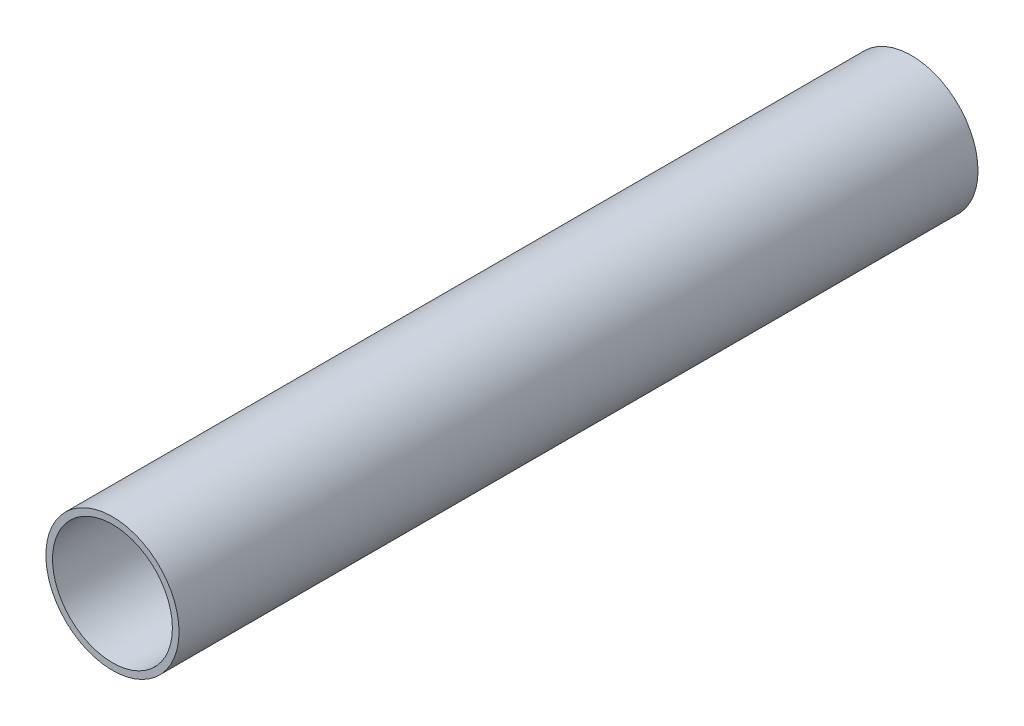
ISO-10303-21;
HEADER;
FILE_DESCRIPTION(('STEP AP214'),'2;1');
FILE_NAME('part.step','',(''),(''),'','','');
FILE_SCHEMA(('AUTOMOTIVE_DESIGN { 1 0 10303 214 1 1 1 1 }'));
ENDSEC;
DATA;
#1=APPLICATION_CONTEXT('core data for automotive mechanical design processes');
#2=APPLICATION_PROTOCOL_DEFINITION('international standard','automotive_design',2000,#1);
#3=PRODUCT_CONTEXT('',#1,'mechanical');
#4=PRODUCT('Part','Part','',(#3));
#5=PRODUCT_RELATED_PRODUCT_CATEGORY('part','',(#4));
#6=PRODUCT_DEFINITION_FORMATION('','',#4);
#7=PRODUCT_DEFINITION_CONTEXT('part definition',#1,'design');
#8=PRODUCT_DEFINITION('design','',#6,#7);
#9=PRODUCT_DEFINITION_SHAPE('','',#8);
#10=(LENGTH_UNIT() NAMED_UNIT(*) SI_UNIT(.MILLI.,.METRE.));
#11=(NAMED_UNIT(*) PLANE_ANGLE_UNIT() SI_UNIT($,.RADIAN.));
#12=(NAMED_UNIT(*) SI_UNIT($,.STERADIAN.) SOLID_ANGLE_UNIT());
#13=UNCERTAINTY_MEASURE_WITH_UNIT(LENGTH_MEASURE(1.E-05),#10,'distance_accuracy_value','');
#14=(GEOMETRIC_REPRESENTATION_CONTEXT(3) GLOBAL_UNCERTAINTY_ASSIGNED_CONTEXT((#13)) GLOBAL_UNIT_ASSIGNED_CONTEXT((#10,
#11,#12)) REPRESENTATION_CONTEXT('',''));
#15=CARTESIAN_POINT('',(0.,0.,0.));
#16=DIRECTION('',(0.,0.,1.));
#17=DIRECTION('',(1.,0.,0.));
#18=AXIS2_PLACEMENT_3D('',#15,#16,#17);
#19=CARTESIAN_POINT('',(0.,0.,30.));
#20=DIRECTION('',(0.,0.,1.));
#21=DIRECTION('',(1.,0.,0.));
#22=AXIS2_PLACEMENT_3D('',#19,#20,#21);
#23=PLANE('',#22);
#24=CARTESIAN_POINT('',(0.,0.,30.));
#25=DIRECTION('',(0.,0.,1.));
#26=DIRECTION('',(1.,0.,0.));
#27=AXIS2_PLACEMENT_3D('',#24,#25,#26);
#28=CIRCLE('',#27,5.);
#29=CARTESIAN_POINT('',(5.,0.,30.));
#30=VERTEX_POINT('',#29);
#31=EDGE_CURVE('E10',#30,#30,#28,.T.);
#32=ORIENTED_EDGE('',*,*,#31,.T.);
#33=EDGE_LOOP('',(#32));
#34=FACE_BOUND('',#33,.T.);
#35=CARTESIAN_POINT('',(0.,0.,30.));
#36=DIRECTION('',(0.,0.,1.));
#37=DIRECTION('',(1.,0.,0.));
#38=AXIS2_PLACEMENT_3D('',#35,#36,#37);
#39=CIRCLE('',#38,4.5);
#40=CARTESIAN_POINT('',(4.5,0.,30.));
#41=VERTEX_POINT('',#40);
#42=EDGE_CURVE('E36',#41,#41,#39,.T.);
#43=ORIENTED_EDGE('',*,*,#42,.F.);
#44=EDGE_LOOP('',(#43));
#45=FACE_BOUND('',#44,.T.);
#46=ADVANCED_FACE('F29',(#34,#45),#23,.T.);
#47=CARTESIAN_POINT('',(0.,0.,30.));
#48=DIRECTION('',(0.,0.,-1.));
#49=DIRECTION('',(-1.,0.,0.));
#50=AXIS2_PLACEMENT_3D('',#47,#48,#49);
#51=CYLINDRICAL_SURFACE('',#50,5.);
#52=ORIENTED_EDGE('',*,*,#31,.F.);
#53=EDGE_LOOP('',(#52));
#54=FACE_BOUND('',#53,.T.);
#55=CARTESIAN_POINT('',(0.,0.,-30.));
#56=DIRECTION('',(0.,0.,1.));
#57=DIRECTION('',(1.,0.,0.));
#58=AXIS2_PLACEMENT_3D('',#55,#56,#57);
#59=CIRCLE('',#58,5.);
#60=CARTESIAN_POINT('',(5.,0.,-30.));
#61=VERTEX_POINT('',#60);
#62=EDGE_CURVE('E40',#61,#61,#59,.T.);
#63=ORIENTED_EDGE('',*,*,#62,.T.);
#64=EDGE_LOOP('',(#63));
#65=FACE_BOUND('',#64,.T.);
#66=ADVANCED_FACE('F31',(#54,#65),#51,.T.);
#67=CARTESIAN_POINT('',(0.,0.,30.));
#68=DIRECTION('',(0.,0.,-1.));
#69=DIRECTION('',(-1.,0.,0.));
#70=AXIS2_PLACEMENT_3D('',#67,#68,#69);
#71=CYLINDRICAL_SURFACE('',#70,4.5);
#72=ORIENTED_EDGE('',*,*,#42,.T.);
#73=EDGE_LOOP('',(#72));
#74=FACE_BOUND('',#73,.T.);
#75=CARTESIAN_POINT('',(0.,0.,-30.));
#76=DIRECTION('',(0.,0.,1.));
#77=DIRECTION('',(1.,0.,0.));
#78=AXIS2_PLACEMENT_3D('',#75,#76,#77);
#79=CIRCLE('',#78,4.5);
#80=CARTESIAN_POINT('',(4.5,0.,-30.));
#81=VERTEX_POINT('',#80);
#82=EDGE_CURVE('E44',#81,#81,#79,.T.);
#83=ORIENTED_EDGE('',*,*,#82,.F.);
#84=EDGE_LOOP('',(#83));
#85=FACE_BOUND('',#84,.T.);
#86=ADVANCED_FACE('F53',(#74,#85),#71,.F.);
#87=CARTESIAN_POINT('',(0.,0.,-30.));
#88=DIRECTION('',(0.,0.,1.));
#89=DIRECTION('',(1.,0.,0.));
#90=AXIS2_PLACEMENT_3D('',#87,#88,#89);
#91=PLANE('',#90);
#92=ORIENTED_EDGE('',*,*,#82,.T.);
#93=EDGE_LOOP('',(#92));
#94=FACE_BOUND('',#93,.T.);
#95=ORIENTED_EDGE('',*,*,#62,.F.);
#96=EDGE_LOOP('',(#95));
#97=FACE_BOUND('',#96,.T.);
#98=ADVANCED_FACE('F50',(#94,#97),#91,.F.);
#99=CLOSED_SHELL('',(#46,#66,#86,#98));
#100=MANIFOLD_SOLID_BREP('B2',#99);
#101=ADVANCED_BREP_SHAPE_REPRESENTATION('',(#18,#100),#14);
#102=SHAPE_DEFINITION_REPRESENTATION(#9,#101);
ENDSEC;
END-ISO-10303-21;
